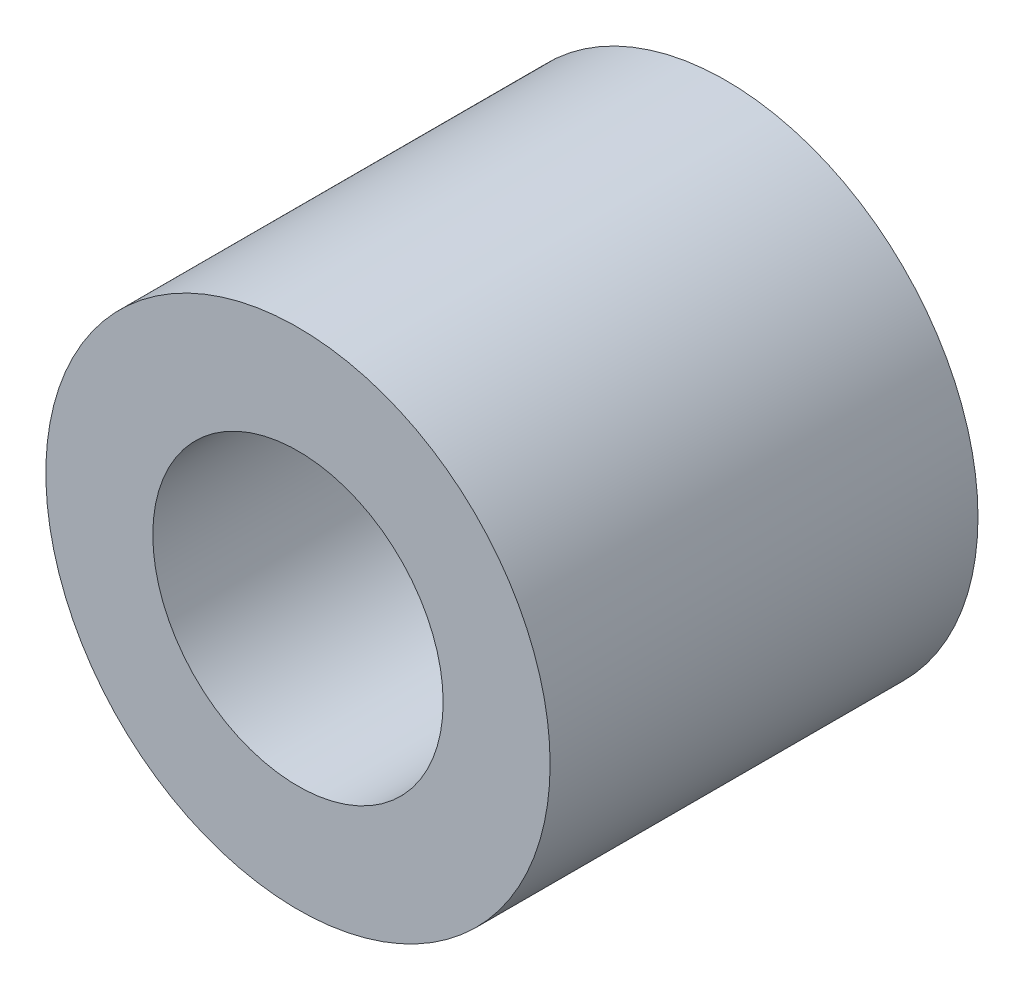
from build123d import *

# Parameters (mm, degrees)
ESQUISSE1_W = 2.8
ESQUISSE1_H = 0.7


with BuildPart() as part:
    # Esquisse1 → Base-R_volution (revolve)
    with BuildSketch(Plane(origin=(0, 0, 0), x_dir=(0, 0, -1), z_dir=(1, 0, 0)), mode=Mode.PRIVATE) as base_r_volution_sk:
        with Locations((0, 1.3)):
            Rectangle(ESQUISSE1_W, ESQUISSE1_H)
    revolve(base_r_volution_sk.sketch.rotate(Axis((0, 0, 6.5), (0, 0, -1)), 90), axis=Axis((0, 0, 6.5), (0, 0, -1)))


solid = part.part
